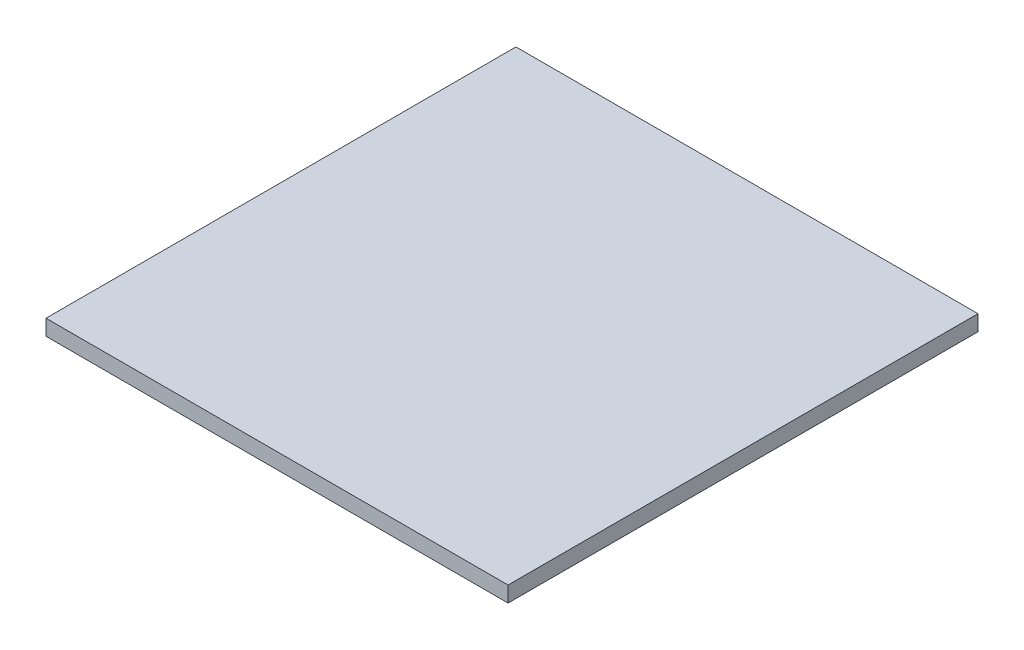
ISO-10303-21;
HEADER;
FILE_DESCRIPTION(('STEP AP214'),'2;1');
FILE_NAME('part.step','',(''),(''),'','','');
FILE_SCHEMA(('AUTOMOTIVE_DESIGN { 1 0 10303 214 1 1 1 1 }'));
ENDSEC;
DATA;
#1=APPLICATION_CONTEXT('core data for automotive mechanical design processes');
#2=APPLICATION_PROTOCOL_DEFINITION('international standard','automotive_design',2000,#1);
#3=PRODUCT_CONTEXT('',#1,'mechanical');
#4=PRODUCT('Part','Part','',(#3));
#5=PRODUCT_RELATED_PRODUCT_CATEGORY('part','',(#4));
#6=PRODUCT_DEFINITION_FORMATION('','',#4);
#7=PRODUCT_DEFINITION_CONTEXT('part definition',#1,'design');
#8=PRODUCT_DEFINITION('design','',#6,#7);
#9=PRODUCT_DEFINITION_SHAPE('','',#8);
#10=(LENGTH_UNIT() NAMED_UNIT(*) SI_UNIT(.MILLI.,.METRE.));
#11=(NAMED_UNIT(*) PLANE_ANGLE_UNIT() SI_UNIT($,.RADIAN.));
#12=(NAMED_UNIT(*) SI_UNIT($,.STERADIAN.) SOLID_ANGLE_UNIT());
#13=UNCERTAINTY_MEASURE_WITH_UNIT(LENGTH_MEASURE(1.E-05),#10,'distance_accuracy_value','');
#14=(GEOMETRIC_REPRESENTATION_CONTEXT(3) GLOBAL_UNCERTAINTY_ASSIGNED_CONTEXT((#13)) GLOBAL_UNIT_ASSIGNED_CONTEXT((#10,
#11,#12)) REPRESENTATION_CONTEXT('',''));
#15=CARTESIAN_POINT('',(0.,0.,0.));
#16=DIRECTION('',(0.,0.,1.));
#17=DIRECTION('',(1.,0.,0.));
#18=AXIS2_PLACEMENT_3D('',#15,#16,#17);
#19=CARTESIAN_POINT('',(14.75,0.5,15.));
#20=DIRECTION('',(-1.,0.,0.));
#21=DIRECTION('',(0.,0.,1.));
#22=AXIS2_PLACEMENT_3D('',#19,#20,#21);
#23=PLANE('',#22);
#24=DIRECTION('',(0.,0.,-1.));
#25=VECTOR('',#24,1.);
#26=CARTESIAN_POINT('',(14.75,-0.5,15.));
#27=LINE('',#26,#25);
#28=CARTESIAN_POINT('',(14.75,-0.5,15.));
#29=VERTEX_POINT('',#28);
#30=CARTESIAN_POINT('',(14.75,-0.5,-15.));
#31=VERTEX_POINT('',#30);
#32=EDGE_CURVE('E107',#29,#31,#27,.T.);
#33=ORIENTED_EDGE('',*,*,#32,.T.);
#34=DIRECTION('',(0.,-1.,0.));
#35=VECTOR('',#34,1.);
#36=CARTESIAN_POINT('',(14.75,0.5,-15.));
#37=LINE('',#36,#35);
#38=CARTESIAN_POINT('',(14.75,0.5,-15.));
#39=VERTEX_POINT('',#38);
#40=EDGE_CURVE('E11',#39,#31,#37,.T.);
#41=ORIENTED_EDGE('',*,*,#40,.F.);
#42=DIRECTION('',(0.,0.,-1.));
#43=VECTOR('',#42,1.);
#44=CARTESIAN_POINT('',(14.75,0.5,15.));
#45=LINE('',#44,#43);
#46=CARTESIAN_POINT('',(14.75,0.5,15.));
#47=VERTEX_POINT('',#46);
#48=EDGE_CURVE('E91',#47,#39,#45,.T.);
#49=ORIENTED_EDGE('',*,*,#48,.F.);
#50=DIRECTION('',(0.,-1.,0.));
#51=VECTOR('',#50,1.);
#52=CARTESIAN_POINT('',(14.75,0.5,15.));
#53=LINE('',#52,#51);
#54=EDGE_CURVE('E103',#47,#29,#53,.T.);
#55=ORIENTED_EDGE('',*,*,#54,.T.);
#56=EDGE_LOOP('',(#33,#41,#49,#55));
#57=FACE_BOUND('',#56,.T.);
#58=ADVANCED_FACE('F39',(#57),#23,.F.);
#59=CARTESIAN_POINT('',(-14.75,0.5,-15.));
#60=DIRECTION('',(0.,0.,1.));
#61=DIRECTION('',(1.,0.,0.));
#62=AXIS2_PLACEMENT_3D('',#59,#60,#61);
#63=PLANE('',#62);
#64=DIRECTION('',(-1.,0.,0.));
#65=VECTOR('',#64,1.);
#66=CARTESIAN_POINT('',(-14.75,-0.5,-15.));
#67=LINE('',#66,#65);
#68=CARTESIAN_POINT('',(-14.75,-0.5,-15.));
#69=VERTEX_POINT('',#68);
#70=EDGE_CURVE('E96',#31,#69,#67,.T.);
#71=ORIENTED_EDGE('',*,*,#70,.T.);
#72=DIRECTION('',(0.,-1.,0.));
#73=VECTOR('',#72,1.);
#74=CARTESIAN_POINT('',(-14.75,0.5,-15.));
#75=LINE('',#74,#73);
#76=CARTESIAN_POINT('',(-14.75,0.5,-15.));
#77=VERTEX_POINT('',#76);
#78=EDGE_CURVE('E48',#77,#69,#75,.T.);
#79=ORIENTED_EDGE('',*,*,#78,.F.);
#80=DIRECTION('',(-1.,0.,0.));
#81=VECTOR('',#80,1.);
#82=CARTESIAN_POINT('',(-14.75,0.5,-15.));
#83=LINE('',#82,#81);
#84=EDGE_CURVE('E86',#39,#77,#83,.T.);
#85=ORIENTED_EDGE('',*,*,#84,.F.);
#86=ORIENTED_EDGE('',*,*,#40,.T.);
#87=EDGE_LOOP('',(#71,#79,#85,#86));
#88=FACE_BOUND('',#87,.T.);
#89=ADVANCED_FACE('F95',(#88),#63,.F.);
#90=CARTESIAN_POINT('',(-14.75,0.5,15.));
#91=DIRECTION('',(1.,0.,0.));
#92=DIRECTION('',(0.,0.,-1.));
#93=AXIS2_PLACEMENT_3D('',#90,#91,#92);
#94=PLANE('',#93);
#95=DIRECTION('',(0.,0.,1.));
#96=VECTOR('',#95,1.);
#97=CARTESIAN_POINT('',(-14.75,-0.5,15.));
#98=LINE('',#97,#96);
#99=CARTESIAN_POINT('',(-14.75,-0.5,15.));
#100=VERTEX_POINT('',#99);
#101=EDGE_CURVE('E73',#69,#100,#98,.T.);
#102=ORIENTED_EDGE('',*,*,#101,.T.);
#103=DIRECTION('',(0.,-1.,0.));
#104=VECTOR('',#103,1.);
#105=CARTESIAN_POINT('',(-14.75,0.5,15.));
#106=LINE('',#105,#104);
#107=CARTESIAN_POINT('',(-14.75,0.5,15.));
#108=VERTEX_POINT('',#107);
#109=EDGE_CURVE('E98',#108,#100,#106,.T.);
#110=ORIENTED_EDGE('',*,*,#109,.F.);
#111=DIRECTION('',(0.,0.,1.));
#112=VECTOR('',#111,1.);
#113=CARTESIAN_POINT('',(-14.75,0.5,15.));
#114=LINE('',#113,#112);
#115=EDGE_CURVE('E89',#77,#108,#114,.T.);
#116=ORIENTED_EDGE('',*,*,#115,.F.);
#117=ORIENTED_EDGE('',*,*,#78,.T.);
#118=EDGE_LOOP('',(#102,#110,#116,#117));
#119=FACE_BOUND('',#118,.T.);
#120=ADVANCED_FACE('F99',(#119),#94,.F.);
#121=CARTESIAN_POINT('',(-14.75,0.5,15.));
#122=DIRECTION('',(0.,0.,-1.));
#123=DIRECTION('',(-1.,0.,0.));
#124=AXIS2_PLACEMENT_3D('',#121,#122,#123);
#125=PLANE('',#124);
#126=DIRECTION('',(1.,0.,0.));
#127=VECTOR('',#126,1.);
#128=CARTESIAN_POINT('',(-14.75,-0.5,15.));
#129=LINE('',#128,#127);
#130=EDGE_CURVE('E79',#100,#29,#129,.T.);
#131=ORIENTED_EDGE('',*,*,#130,.T.);
#132=ORIENTED_EDGE('',*,*,#54,.F.);
#133=DIRECTION('',(1.,0.,0.));
#134=VECTOR('',#133,1.);
#135=CARTESIAN_POINT('',(-14.75,0.5,15.));
#136=LINE('',#135,#134);
#137=EDGE_CURVE('E56',#108,#47,#136,.T.);
#138=ORIENTED_EDGE('',*,*,#137,.F.);
#139=ORIENTED_EDGE('',*,*,#109,.T.);
#140=EDGE_LOOP('',(#131,#132,#138,#139));
#141=FACE_BOUND('',#140,.T.);
#142=ADVANCED_FACE('F120',(#141),#125,.F.);
#143=CARTESIAN_POINT('',(0.,0.5,0.));
#144=DIRECTION('',(0.,-1.,0.));
#145=DIRECTION('',(0.,0.,-1.));
#146=AXIS2_PLACEMENT_3D('',#143,#144,#145);
#147=PLANE('',#146);
#148=ORIENTED_EDGE('',*,*,#48,.T.);
#149=ORIENTED_EDGE('',*,*,#84,.T.);
#150=ORIENTED_EDGE('',*,*,#115,.T.);
#151=ORIENTED_EDGE('',*,*,#137,.T.);
#152=EDGE_LOOP('',(#148,#149,#150,#151));
#153=FACE_BOUND('',#152,.T.);
#154=ADVANCED_FACE('F87',(#153),#147,.F.);
#155=CARTESIAN_POINT('',(0.,-0.5,0.));
#156=DIRECTION('',(0.,-1.,0.));
#157=DIRECTION('',(0.,0.,-1.));
#158=AXIS2_PLACEMENT_3D('',#155,#156,#157);
#159=PLANE('',#158);
#160=ORIENTED_EDGE('',*,*,#32,.F.);
#161=ORIENTED_EDGE('',*,*,#130,.F.);
#162=ORIENTED_EDGE('',*,*,#101,.F.);
#163=ORIENTED_EDGE('',*,*,#70,.F.);
#164=EDGE_LOOP('',(#160,#161,#162,#163));
#165=FACE_BOUND('',#164,.T.);
#166=ADVANCED_FACE('F123',(#165),#159,.T.);
#167=CLOSED_SHELL('',(#58,#89,#120,#142,#154,#166));
#168=MANIFOLD_SOLID_BREP('B2',#167);
#169=ADVANCED_BREP_SHAPE_REPRESENTATION('',(#18,#168),#14);
#170=SHAPE_DEFINITION_REPRESENTATION(#9,#169);
ENDSEC;
END-ISO-10303-21;
